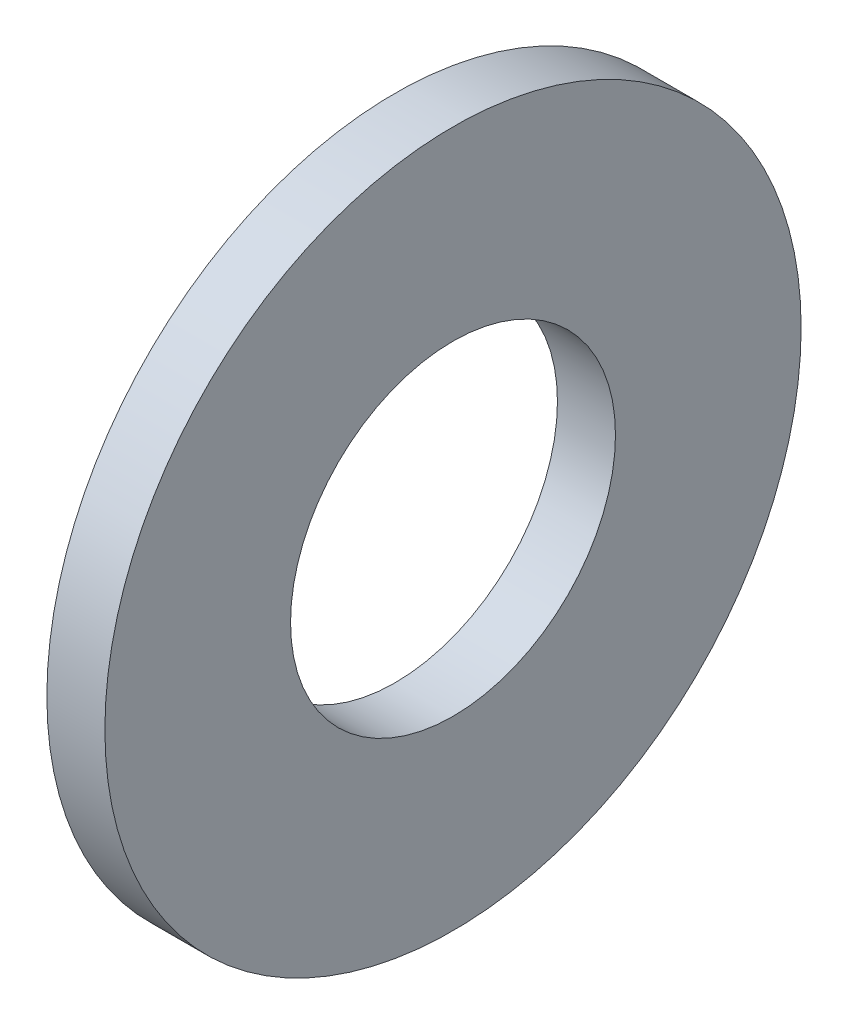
from build123d import *

# Parameters (mm, degrees)
ESQUISSE1_W = 1.5
ESQUISSE1_H = 4.8


with BuildPart() as part:
    # Esquisse1 → Base-R_volution (revolve)
    with BuildSketch(Plane(origin=(0, 0, 0), x_dir=(1, 0, 0), z_dir=(0, 1, 0)), mode=Mode.PRIVATE) as base_r_volution_sk:
        with Locations((0.75, 6.6)):
            Rectangle(ESQUISSE1_W, ESQUISSE1_H)
    revolve(base_r_volution_sk.sketch.rotate(Axis((0, 0, 0), (1, 0, 0)), 180), axis=Axis((0, 0, 0), (1, 0, 0)))


solid = part.part
